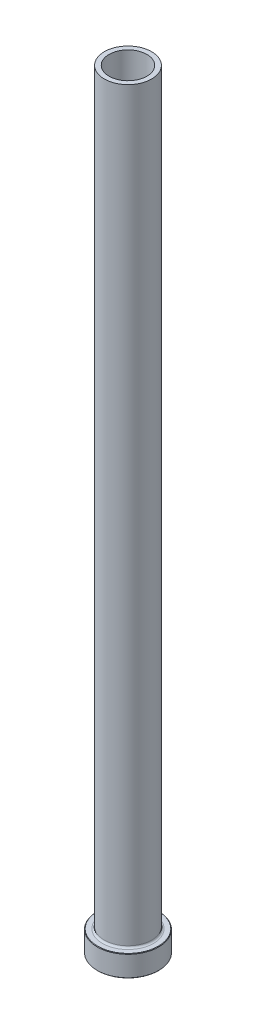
ISO-10303-21;
HEADER;
FILE_DESCRIPTION(('STEP AP214'),'2;1');
FILE_NAME('part.step','',(''),(''),'','','');
FILE_SCHEMA(('AUTOMOTIVE_DESIGN { 1 0 10303 214 1 1 1 1 }'));
ENDSEC;
DATA;
#1=APPLICATION_CONTEXT('core data for automotive mechanical design processes');
#2=APPLICATION_PROTOCOL_DEFINITION('international standard','automotive_design',2000,#1);
#3=PRODUCT_CONTEXT('',#1,'mechanical');
#4=PRODUCT('Part','Part','',(#3));
#5=PRODUCT_RELATED_PRODUCT_CATEGORY('part','',(#4));
#6=PRODUCT_DEFINITION_FORMATION('','',#4);
#7=PRODUCT_DEFINITION_CONTEXT('part definition',#1,'design');
#8=PRODUCT_DEFINITION('design','',#6,#7);
#9=PRODUCT_DEFINITION_SHAPE('','',#8);
#10=(LENGTH_UNIT() NAMED_UNIT(*) SI_UNIT(.MILLI.,.METRE.));
#11=(NAMED_UNIT(*) PLANE_ANGLE_UNIT() SI_UNIT($,.RADIAN.));
#12=(NAMED_UNIT(*) SI_UNIT($,.STERADIAN.) SOLID_ANGLE_UNIT());
#13=UNCERTAINTY_MEASURE_WITH_UNIT(LENGTH_MEASURE(1.E-05),#10,'distance_accuracy_value','');
#14=(GEOMETRIC_REPRESENTATION_CONTEXT(3) GLOBAL_UNCERTAINTY_ASSIGNED_CONTEXT((#13)) GLOBAL_UNIT_ASSIGNED_CONTEXT((#10,
#11,#12)) REPRESENTATION_CONTEXT('',''));
#15=CARTESIAN_POINT('',(0.,0.,0.));
#16=DIRECTION('',(0.,0.,1.));
#17=DIRECTION('',(1.,0.,0.));
#18=AXIS2_PLACEMENT_3D('',#15,#16,#17);
#19=CARTESIAN_POINT('',(0.,92.1876809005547,0.));
#20=DIRECTION('',(0.,1.,0.));
#21=DIRECTION('',(0.,0.,1.));
#22=AXIS2_PLACEMENT_3D('',#19,#20,#21);
#23=CYLINDRICAL_SURFACE('',#22,8.00000000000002);
#24=CARTESIAN_POINT('',(0.,325.,0.));
#25=DIRECTION('',(0.,1.,0.));
#26=DIRECTION('',(0.,0.,1.));
#27=AXIS2_PLACEMENT_3D('',#24,#25,#26);
#28=CIRCLE('',#27,8.00000000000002);
#29=CARTESIAN_POINT('',(0.,325.,8.00000000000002));
#30=VERTEX_POINT('',#29);
#31=EDGE_CURVE('E62',#30,#30,#28,.T.);
#32=ORIENTED_EDGE('',*,*,#31,.T.);
#33=EDGE_LOOP('',(#32));
#34=FACE_BOUND('',#33,.T.);
#35=CARTESIAN_POINT('',(0.,270.,0.));
#36=DIRECTION('',(0.,1.,0.));
#37=DIRECTION('',(0.,0.,1.));
#38=AXIS2_PLACEMENT_3D('',#35,#36,#37);
#39=CIRCLE('',#38,8.00000000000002);
#40=CARTESIAN_POINT('',(0.,270.,8.00000000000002));
#41=VERTEX_POINT('',#40);
#42=EDGE_CURVE('E71',#41,#41,#39,.T.);
#43=ORIENTED_EDGE('',*,*,#42,.F.);
#44=EDGE_LOOP('',(#43));
#45=FACE_BOUND('',#44,.T.);
#46=ADVANCED_FACE('F30',(#34,#45),#23,.F.);
#47=CARTESIAN_POINT('',(-8.00000000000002,325.,0.));
#48=DIRECTION('',(0.,1.,0.));
#49=DIRECTION('',(0.,0.,1.));
#50=AXIS2_PLACEMENT_3D('',#47,#48,#49);
#51=PLANE('',#50);
#52=CARTESIAN_POINT('',(0.,325.,0.));
#53=DIRECTION('',(0.,1.,0.));
#54=DIRECTION('',(0.,0.,1.));
#55=AXIS2_PLACEMENT_3D('',#52,#53,#54);
#56=CIRCLE('',#55,10.);
#57=CARTESIAN_POINT('',(0.,325.,10.));
#58=VERTEX_POINT('',#57);
#59=EDGE_CURVE('E65',#58,#58,#56,.T.);
#60=ORIENTED_EDGE('',*,*,#59,.T.);
#61=EDGE_LOOP('',(#60));
#62=FACE_BOUND('',#61,.T.);
#63=ORIENTED_EDGE('',*,*,#31,.F.);
#64=EDGE_LOOP('',(#63));
#65=FACE_BOUND('',#64,.T.);
#66=ADVANCED_FACE('F79',(#62,#65),#51,.T.);
#67=CARTESIAN_POINT('',(0.,92.1876809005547,0.));
#68=DIRECTION('',(0.,1.,0.));
#69=DIRECTION('',(0.,0.,1.));
#70=AXIS2_PLACEMENT_3D('',#67,#68,#69);
#71=CYLINDRICAL_SURFACE('',#70,10.);
#72=CARTESIAN_POINT('',(0.,9.8,0.));
#73=DIRECTION('',(0.,1.,0.));
#74=DIRECTION('',(0.,0.,1.));
#75=AXIS2_PLACEMENT_3D('',#72,#73,#74);
#76=CIRCLE('',#75,10.);
#77=CARTESIAN_POINT('',(0.,9.8,10.));
#78=VERTEX_POINT('',#77);
#79=EDGE_CURVE('E59',#78,#78,#76,.T.);
#80=ORIENTED_EDGE('',*,*,#79,.T.);
#81=EDGE_LOOP('',(#80));
#82=FACE_BOUND('',#81,.T.);
#83=ORIENTED_EDGE('',*,*,#59,.F.);
#84=EDGE_LOOP('',(#83));
#85=FACE_BOUND('',#84,.T.);
#86=ADVANCED_FACE('F85',(#82,#85),#71,.T.);
#87=CARTESIAN_POINT('',(-9.99999999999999,9.,0.));
#88=DIRECTION('',(0.,1.,0.));
#89=DIRECTION('',(0.,0.,1.));
#90=AXIS2_PLACEMENT_3D('',#87,#88,#89);
#91=PLANE('',#90);
#92=CARTESIAN_POINT('',(0.,9.,0.));
#93=DIRECTION('',(0.,1.,0.));
#94=DIRECTION('',(0.,0.,1.));
#95=AXIS2_PLACEMENT_3D('',#92,#93,#94);
#96=CIRCLE('',#95,12.8000000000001);
#97=CARTESIAN_POINT('',(0.,9.,12.8000000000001));
#98=VERTEX_POINT('',#97);
#99=EDGE_CURVE('E53',#98,#98,#96,.T.);
#100=ORIENTED_EDGE('',*,*,#99,.T.);
#101=EDGE_LOOP('',(#100));
#102=FACE_BOUND('',#101,.T.);
#103=CARTESIAN_POINT('',(0.,9.,0.));
#104=DIRECTION('',(0.,1.,0.));
#105=DIRECTION('',(0.,0.,1.));
#106=AXIS2_PLACEMENT_3D('',#103,#104,#105);
#107=CIRCLE('',#106,10.8);
#108=CARTESIAN_POINT('',(0.,9.,10.8));
#109=VERTEX_POINT('',#108);
#110=EDGE_CURVE('E56',#109,#109,#107,.F.);
#111=ORIENTED_EDGE('',*,*,#110,.T.);
#112=EDGE_LOOP('',(#111));
#113=FACE_BOUND('',#112,.T.);
#114=ADVANCED_FACE('F111',(#102,#113),#91,.T.);
#115=CARTESIAN_POINT('',(0.,92.1876809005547,0.));
#116=DIRECTION('',(0.,1.,0.));
#117=DIRECTION('',(0.,0.,1.));
#118=AXIS2_PLACEMENT_3D('',#115,#116,#117);
#119=CYLINDRICAL_SURFACE('',#118,13.);
#120=CARTESIAN_POINT('',(0.,8.80000000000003,0.));
#121=DIRECTION('',(0.,1.,0.));
#122=DIRECTION('',(0.,0.,1.));
#123=AXIS2_PLACEMENT_3D('',#120,#121,#122);
#124=CIRCLE('',#123,13.);
#125=CARTESIAN_POINT('',(0.,8.80000000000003,13.));
#126=VERTEX_POINT('',#125);
#127=EDGE_CURVE('E45',#126,#126,#124,.F.);
#128=ORIENTED_EDGE('',*,*,#127,.T.);
#129=EDGE_LOOP('',(#128));
#130=FACE_BOUND('',#129,.T.);
#131=CARTESIAN_POINT('',(0.,0.199999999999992,0.));
#132=DIRECTION('',(0.,-1.,0.));
#133=DIRECTION('',(0.,0.,-1.));
#134=AXIS2_PLACEMENT_3D('',#131,#132,#133);
#135=CIRCLE('',#134,13.);
#136=CARTESIAN_POINT('',(0.,0.199999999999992,-13.));
#137=VERTEX_POINT('',#136);
#138=EDGE_CURVE('E50',#137,#137,#135,.F.);
#139=ORIENTED_EDGE('',*,*,#138,.T.);
#140=EDGE_LOOP('',(#139));
#141=FACE_BOUND('',#140,.T.);
#142=ADVANCED_FACE('F108',(#130,#141),#119,.T.);
#143=CARTESIAN_POINT('',(-13.,0.,0.));
#144=DIRECTION('',(0.,-1.,0.));
#145=DIRECTION('',(0.,0.,-1.));
#146=AXIS2_PLACEMENT_3D('',#143,#144,#145);
#147=PLANE('',#146);
#148=CARTESIAN_POINT('',(0.,0.,0.));
#149=DIRECTION('',(0.,-1.,0.));
#150=DIRECTION('',(0.,0.,-1.));
#151=AXIS2_PLACEMENT_3D('',#148,#149,#150);
#152=CIRCLE('',#151,8.74999999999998);
#153=CARTESIAN_POINT('',(0.,0.,-8.74999999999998));
#154=VERTEX_POINT('',#153);
#155=EDGE_CURVE('E37',#154,#154,#152,.F.);
#156=ORIENTED_EDGE('',*,*,#155,.T.);
#157=EDGE_LOOP('',(#156));
#158=FACE_BOUND('',#157,.T.);
#159=CARTESIAN_POINT('',(0.,0.,0.));
#160=DIRECTION('',(0.,-1.,0.));
#161=DIRECTION('',(0.,0.,-1.));
#162=AXIS2_PLACEMENT_3D('',#159,#160,#161);
#163=CIRCLE('',#162,12.8);
#164=CARTESIAN_POINT('',(0.,0.,-12.8));
#165=VERTEX_POINT('',#164);
#166=EDGE_CURVE('E41',#165,#165,#163,.T.);
#167=ORIENTED_EDGE('',*,*,#166,.T.);
#168=EDGE_LOOP('',(#167));
#169=FACE_BOUND('',#168,.T.);
#170=ADVANCED_FACE('F110',(#158,#169),#147,.T.);
#171=CARTESIAN_POINT('',(0.,92.1876809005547,0.));
#172=DIRECTION('',(0.,1.,0.));
#173=DIRECTION('',(0.,0.,1.));
#174=AXIS2_PLACEMENT_3D('',#171,#172,#173);
#175=CYLINDRICAL_SURFACE('',#174,8.25000000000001);
#176=CARTESIAN_POINT('',(0.,0.5,0.));
#177=DIRECTION('',(0.,-1.,0.));
#178=DIRECTION('',(0.,0.,-1.));
#179=AXIS2_PLACEMENT_3D('',#176,#177,#178);
#180=CIRCLE('',#179,8.25000000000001);
#181=CARTESIAN_POINT('',(0.,0.5,-8.25000000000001));
#182=VERTEX_POINT('',#181);
#183=EDGE_CURVE('E10',#182,#182,#180,.T.);
#184=ORIENTED_EDGE('',*,*,#183,.T.);
#185=EDGE_LOOP('',(#184));
#186=FACE_BOUND('',#185,.T.);
#187=CARTESIAN_POINT('',(0.,258.,0.));
#188=DIRECTION('',(0.,1.,0.));
#189=DIRECTION('',(0.,0.,1.));
#190=AXIS2_PLACEMENT_3D('',#187,#188,#189);
#191=CIRCLE('',#190,8.25000000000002);
#192=CARTESIAN_POINT('',(0.,258.,8.25000000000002));
#193=VERTEX_POINT('',#192);
#194=EDGE_CURVE('E68',#193,#193,#191,.T.);
#195=ORIENTED_EDGE('',*,*,#194,.T.);
#196=EDGE_LOOP('',(#195));
#197=FACE_BOUND('',#196,.T.);
#198=ADVANCED_FACE('F118',(#186,#197),#175,.F.);
#199=CARTESIAN_POINT('',(0.,258.,0.));
#200=DIRECTION('',(0.,-1.,0.));
#201=DIRECTION('',(0.,0.,-1.));
#202=AXIS2_PLACEMENT_3D('',#199,#200,#201);
#203=CONICAL_SURFACE('',#202,8.25000000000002,0.0208303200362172);
#204=ORIENTED_EDGE('',*,*,#42,.T.);
#205=EDGE_LOOP('',(#204));
#206=FACE_BOUND('',#205,.T.);
#207=ORIENTED_EDGE('',*,*,#194,.F.);
#208=EDGE_LOOP('',(#207));
#209=FACE_BOUND('',#208,.T.);
#210=ADVANCED_FACE('F75',(#206,#209),#203,.F.);
#211=CARTESIAN_POINT('',(0.,9.8,0.));
#212=DIRECTION('',(0.,1.,0.));
#213=DIRECTION('',(0.,0.,1.));
#214=AXIS2_PLACEMENT_3D('',#211,#212,#213);
#215=TOROIDAL_SURFACE('',#214,10.8,0.8);
#216=ORIENTED_EDGE('',*,*,#110,.F.);
#217=EDGE_LOOP('',(#216));
#218=FACE_BOUND('',#217,.T.);
#219=ORIENTED_EDGE('',*,*,#79,.F.);
#220=EDGE_LOOP('',(#219));
#221=FACE_BOUND('',#220,.T.);
#222=ADVANCED_FACE('F90',(#218,#221),#215,.F.);
#223=CARTESIAN_POINT('',(0.,8.99999999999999,0.));
#224=DIRECTION('',(0.,-1.,0.));
#225=DIRECTION('',(0.,0.,-1.));
#226=AXIS2_PLACEMENT_3D('',#223,#224,#225);
#227=CONICAL_SURFACE('',#226,12.8000000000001,0.785398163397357);
#228=ORIENTED_EDGE('',*,*,#127,.F.);
#229=EDGE_LOOP('',(#228));
#230=FACE_BOUND('',#229,.T.);
#231=ORIENTED_EDGE('',*,*,#99,.F.);
#232=EDGE_LOOP('',(#231));
#233=FACE_BOUND('',#232,.T.);
#234=ADVANCED_FACE('F93',(#230,#233),#227,.T.);
#235=CARTESIAN_POINT('',(0.,0.199999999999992,0.));
#236=DIRECTION('',(0.,1.,0.));
#237=DIRECTION('',(0.,0.,1.));
#238=AXIS2_PLACEMENT_3D('',#235,#236,#237);
#239=CONICAL_SURFACE('',#238,13.,0.785398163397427);
#240=ORIENTED_EDGE('',*,*,#166,.F.);
#241=EDGE_LOOP('',(#240));
#242=FACE_BOUND('',#241,.T.);
#243=ORIENTED_EDGE('',*,*,#138,.F.);
#244=EDGE_LOOP('',(#243));
#245=FACE_BOUND('',#244,.T.);
#246=ADVANCED_FACE('F96',(#242,#245),#239,.T.);
#247=CARTESIAN_POINT('',(0.,0.,0.));
#248=DIRECTION('',(0.,-1.,0.));
#249=DIRECTION('',(0.,0.,-1.));
#250=AXIS2_PLACEMENT_3D('',#247,#248,#249);
#251=CONICAL_SURFACE('',#250,8.74999999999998,0.785398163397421);
#252=ORIENTED_EDGE('',*,*,#183,.F.);
#253=EDGE_LOOP('',(#252));
#254=FACE_BOUND('',#253,.T.);
#255=ORIENTED_EDGE('',*,*,#155,.F.);
#256=EDGE_LOOP('',(#255));
#257=FACE_BOUND('',#256,.T.);
#258=ADVANCED_FACE('F32',(#254,#257),#251,.F.);
#259=CLOSED_SHELL('',(#46,#66,#86,#114,#142,#170,#198,#210,#222,#234,#246,#258));
#260=MANIFOLD_SOLID_BREP('B2',#259);
#261=ADVANCED_BREP_SHAPE_REPRESENTATION('',(#18,#260),#14);
#262=SHAPE_DEFINITION_REPRESENTATION(#9,#261);
ENDSEC;
END-ISO-10303-21;
